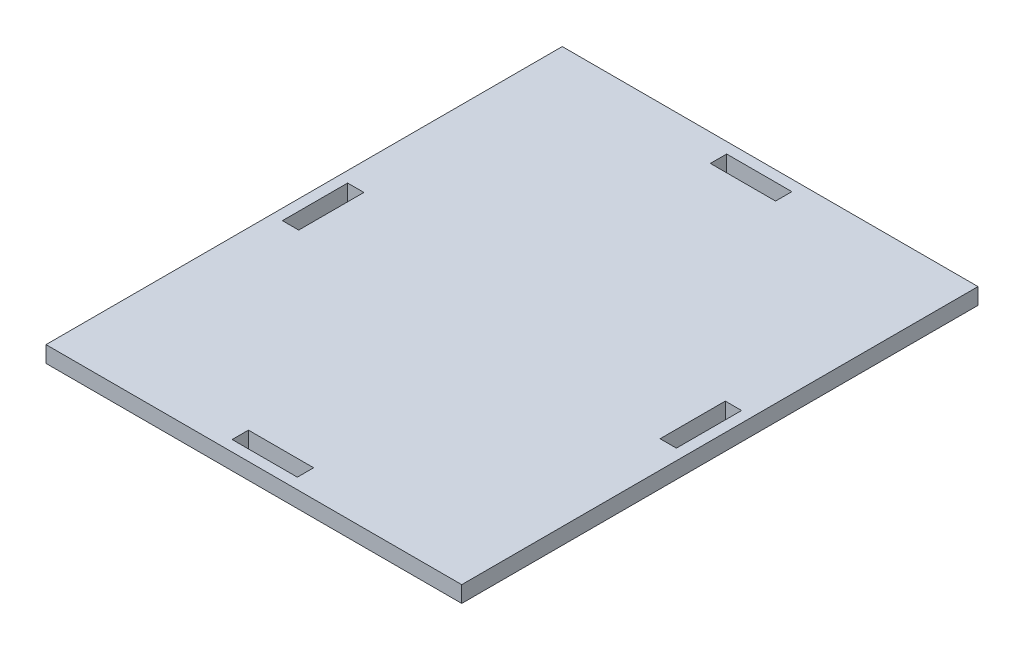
from build123d import *

# Parameters (mm, degrees)
SKETCH1_W           = 72.5
SKETCH1_H           = 2
SKETCH1_W_2         = 2
BOSS_EXTRUDE2_DEPTH = 3


with BuildPart() as part:
    # Sketch1 → Boss-Extrude2 (new body)
    with BuildSketch(Plane(origin=(0, 0, 0), x_dir=(1, 0, 0), z_dir=(0, 1, 0))):
        Polygon((-6, 45.5), (-36.25, 45.5), (-36.25, 6), (-33.25, 6), (-33.25, -6), (-36.25, -6), (-36.25, -45.5), (-6, -45.5), (-6, -42.5), (6, -42.5), (6, -45.5), (36.25, -45.5), (36.25, -6), (33.25, -6), (33.25, 6), (36.25, 6), (36.25, 45.5), (6, 45.5), (6, 42.5), (-6, 42.5), align=None)
        Polygon((-36.25, -47.5), (36.25, -47.5), (38.25, -47.5), (38.25, 45.5), (38.25, 47.5), (36.25, 47.5), (36.25, 45.5), (36.25, -45.5), (-36.25, -45.5), align=None)
        Polygon((-36.25, 45.5), (-38.25, 45.5), (-38.25, -47.5), (-36.25, -47.5), (-36.25, -45.5), align=None)
        with Locations((0, 46.5)):
            Rectangle(SKETCH1_W, SKETCH1_H)
        with Locations((-37.25, 46.5)):
            Rectangle(SKETCH1_W_2, SKETCH1_H)
    extrude(amount=BOSS_EXTRUDE2_DEPTH)


solid = part.part
